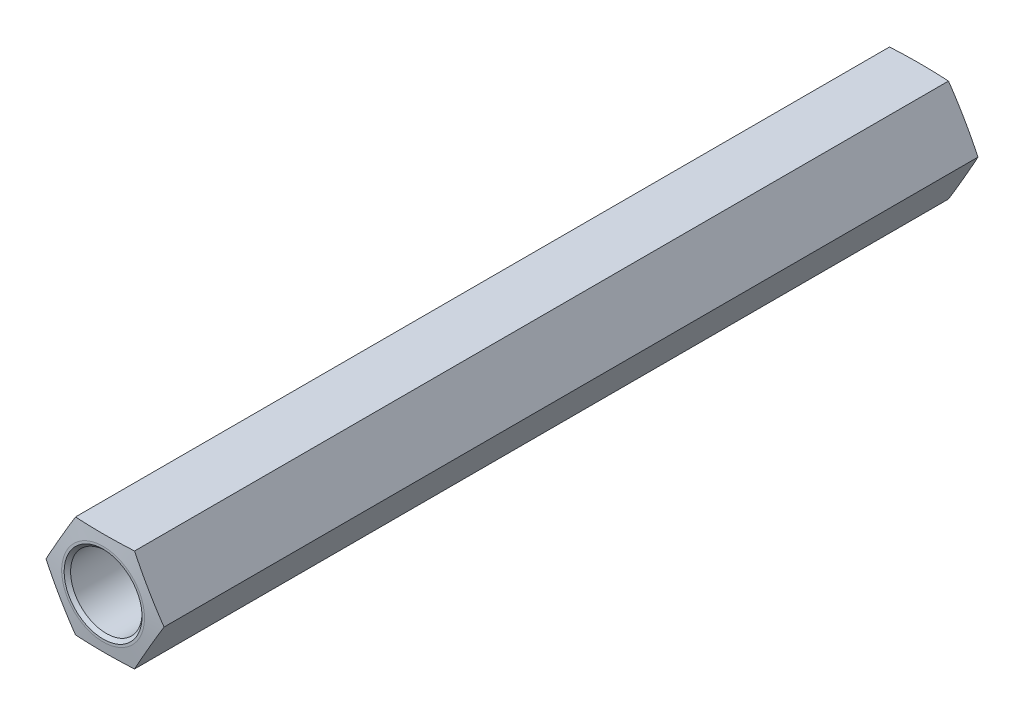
from build123d import *

# Parameters (mm, degrees)
SKETCH1_R      = 2.220000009
EXTRUDE1_DEPTH = 25.4
CHAMFER1_SIZE  = 0.2


with BuildPart() as part:
    # Sketch1 → Extrude1 (new, symmetric)
    with BuildSketch(Plane.XY):
        Polygon((-3.666174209, -6.3e-08), (-1.833087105, -3.175000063), (1.833087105, -3.174999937), (3.666174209, 6.3e-08), (1.833087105, 3.175000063), (-1.833087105, 3.174999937), align=None)
        with Locations((0, -6.3e-08)):
            Circle(SKETCH1_R, mode=Mode.SUBTRACT)
    extrude(amount=EXTRUDE1_DEPTH, both=True)

    # Chamfer1
    chamfer1_edges = [part.edges().sort_by_distance(p)[0] for p in [
        (-2.220000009, -6.3e-08, -25.4),
        (-2.220000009, -6.3e-08, 25.4),
    ]]
    chamfer(chamfer1_edges, length=CHAMFER1_SIZE)

    # Sketch2 → Cut-Revolve1 (revolve, cut)
    with BuildSketch(Plane.XZ, mode=Mode.PRIVATE) as cut_revolve1_sk:
        Polygon((-2.572739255, -25.4), (-3.666174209, -25.28), (-3.666174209, -25.4), align=None)
    cut_revolve1 = revolve(cut_revolve1_sk.sketch.rotate(Axis((0, -6.3e-08, 25.4), (0, 0, -1)), 359.999998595), axis=Axis((0, -6.3e-08, 25.4), (0, 0, -1)), mode=Mode.SUBTRACT)

    # Mirror1: Cut-Revolve1 across plane
    add(cut_revolve1.mirror(Plane.XY), mode=Mode.SUBTRACT)


solid = part.part
